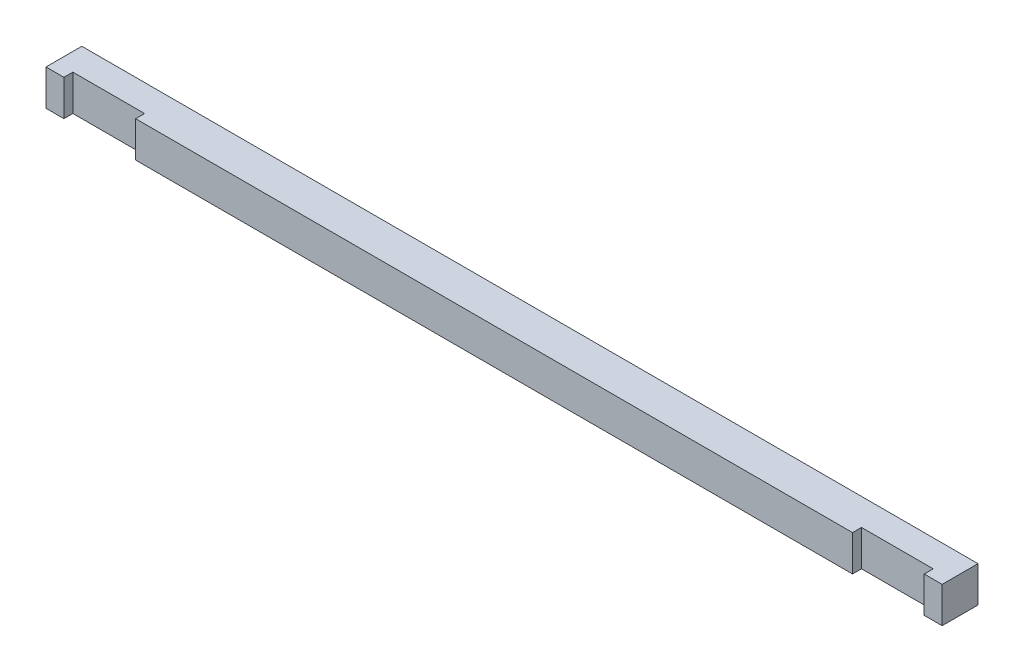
from build123d import *

# Parameters (mm, degrees)
EXTRUDE_1_DEPTH = 10


with BuildPart() as part:
    # Sketch 1 → Extrude 1 (new body)
    with BuildSketch(Plane(origin=(0, 0, 0), x_dir=(1, 0, 0), z_dir=(0, 1, 0))):
        Polygon((-125, 10), (125, 10), (125, 0), (120, 0), (120, 2.5), (100, 2.5), (100, 0), (-100, 0), (-100, 2.5), (-120, 2.5), (-120, 0), (-125, 0), align=None)
    extrude(amount=EXTRUDE_1_DEPTH)


solid = part.part
